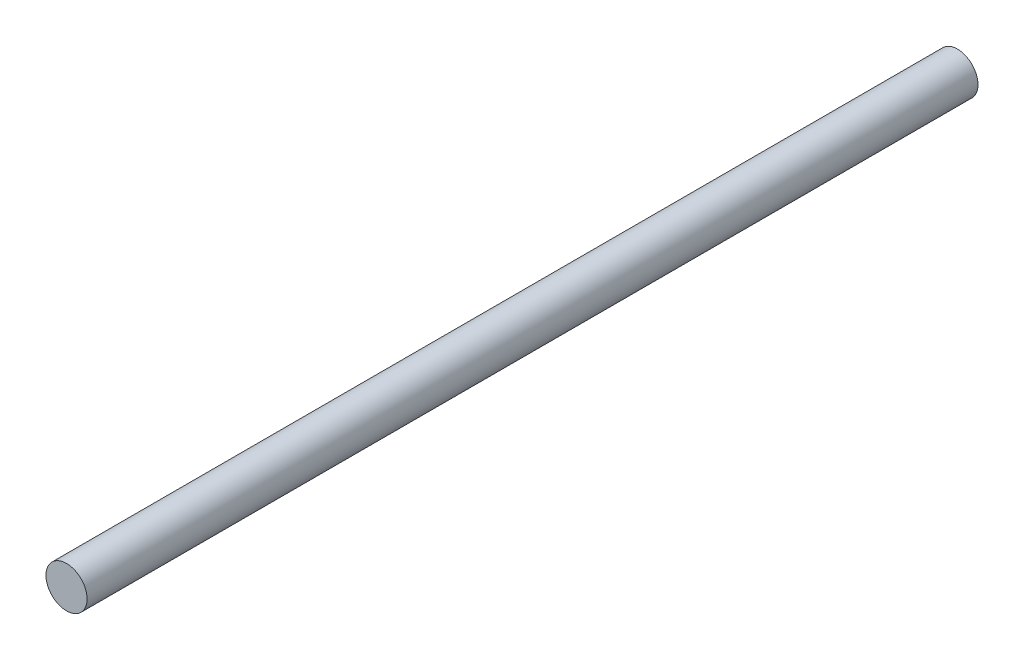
from build123d import *

# Parameters (mm, degrees)
ESQUISSE1_R        = 3
BOSS_EXTRU_1_DEPTH = 130


with BuildPart() as part:
    # Esquisse1 → Boss.-Extru.1 (new body)
    with BuildSketch(Plane.XY):
        Circle(ESQUISSE1_R)
    extrude(amount=BOSS_EXTRU_1_DEPTH)


solid = part.part
